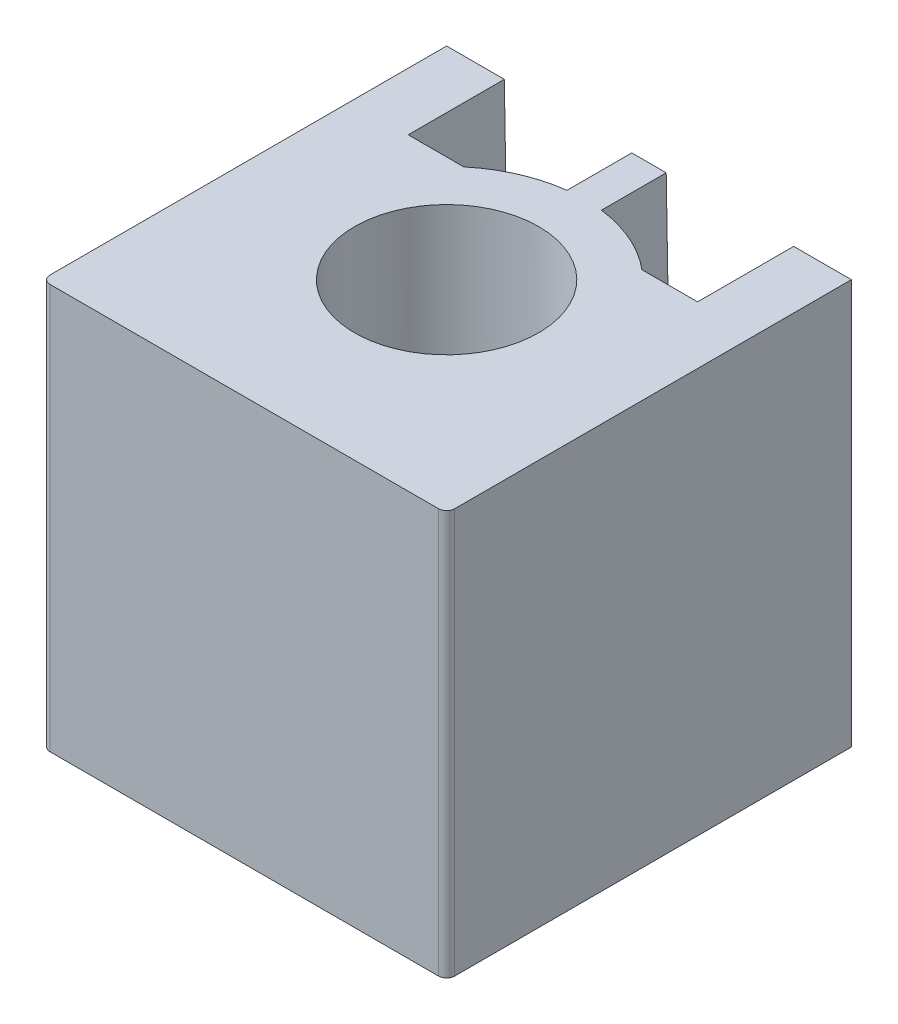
ISO-10303-21;
HEADER;
FILE_DESCRIPTION(('STEP AP214'),'2;1');
FILE_NAME('part.step','',(''),(''),'','','');
FILE_SCHEMA(('AUTOMOTIVE_DESIGN { 1 0 10303 214 1 1 1 1 }'));
ENDSEC;
DATA;
#1=APPLICATION_CONTEXT('core data for automotive mechanical design processes');
#2=APPLICATION_PROTOCOL_DEFINITION('international standard','automotive_design',2000,#1);
#3=PRODUCT_CONTEXT('',#1,'mechanical');
#4=PRODUCT('Part','Part','',(#3));
#5=PRODUCT_RELATED_PRODUCT_CATEGORY('part','',(#4));
#6=PRODUCT_DEFINITION_FORMATION('','',#4);
#7=PRODUCT_DEFINITION_CONTEXT('part definition',#1,'design');
#8=PRODUCT_DEFINITION('design','',#6,#7);
#9=PRODUCT_DEFINITION_SHAPE('','',#8);
#10=(LENGTH_UNIT() NAMED_UNIT(*) SI_UNIT(.MILLI.,.METRE.));
#11=(NAMED_UNIT(*) PLANE_ANGLE_UNIT() SI_UNIT($,.RADIAN.));
#12=(NAMED_UNIT(*) SI_UNIT($,.STERADIAN.) SOLID_ANGLE_UNIT());
#13=UNCERTAINTY_MEASURE_WITH_UNIT(LENGTH_MEASURE(1.E-05),#10,'distance_accuracy_value','');
#14=(GEOMETRIC_REPRESENTATION_CONTEXT(3) GLOBAL_UNCERTAINTY_ASSIGNED_CONTEXT((#13)) GLOBAL_UNIT_ASSIGNED_CONTEXT((#10,
#11,#12)) REPRESENTATION_CONTEXT('',''));
#15=CARTESIAN_POINT('',(0.,0.,0.));
#16=DIRECTION('',(0.,0.,1.));
#17=DIRECTION('',(1.,0.,0.));
#18=AXIS2_PLACEMENT_3D('',#15,#16,#17);
#19=CARTESIAN_POINT('',(0.,25.,-25.));
#20=DIRECTION('',(0.,0.,1.));
#21=DIRECTION('',(1.,0.,0.));
#22=AXIS2_PLACEMENT_3D('',#19,#20,#21);
#23=PLANE('',#22);
#24=DIRECTION('',(-1.,0.,0.));
#25=VECTOR('',#24,1.);
#26=CARTESIAN_POINT('',(0.,0.,-25.));
#27=LINE('',#26,#25);
#28=CARTESIAN_POINT('',(25.,0.,-25.));
#29=VERTEX_POINT('',#28);
#30=CARTESIAN_POINT('',(21.,0.,-25.));
#31=VERTEX_POINT('',#30);
#32=EDGE_CURVE('E333',#29,#31,#27,.T.);
#33=ORIENTED_EDGE('',*,*,#32,.T.);
#34=DIRECTION('',(0.0174524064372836,0.999847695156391,0.));
#35=VECTOR('',#34,1.);
#36=CARTESIAN_POINT('',(21.4298473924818,24.6259406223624,-25.));
#37=LINE('',#36,#35);
#38=CARTESIAN_POINT('',(21.4363766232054,25.,-25.));
#39=VERTEX_POINT('',#38);
#40=EDGE_CURVE('E351',#31,#39,#37,.T.);
#41=ORIENTED_EDGE('',*,*,#40,.T.);
#42=DIRECTION('',(-1.,0.,0.));
#43=VECTOR('',#42,1.);
#44=CARTESIAN_POINT('',(0.,25.,-25.));
#45=LINE('',#44,#43);
#46=CARTESIAN_POINT('',(25.,25.,-25.));
#47=VERTEX_POINT('',#46);
#48=EDGE_CURVE('E276',#47,#39,#45,.T.);
#49=ORIENTED_EDGE('',*,*,#48,.F.);
#50=DIRECTION('',(0.,-1.,0.));
#51=VECTOR('',#50,1.);
#52=CARTESIAN_POINT('',(25.,25.,-25.));
#53=LINE('',#52,#51);
#54=EDGE_CURVE('E305',#47,#29,#53,.T.);
#55=ORIENTED_EDGE('',*,*,#54,.T.);
#56=EDGE_LOOP('',(#33,#41,#49,#55));
#57=FACE_BOUND('',#56,.T.);
#58=ADVANCED_FACE('F26',(#57),#23,.F.);
#59=CARTESIAN_POINT('',(3.56362337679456,25.,-25.));
#60=VERTEX_POINT('',#59);
#61=CARTESIAN_POINT('',(0.,25.,-25.));
#62=VERTEX_POINT('',#61);
#63=EDGE_CURVE('E265',#60,#62,#45,.T.);
#64=ORIENTED_EDGE('',*,*,#63,.F.);
#65=DIRECTION('',(0.0174524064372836,-0.999847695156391,0.));
#66=VECTOR('',#65,1.);
#67=CARTESIAN_POINT('',(3.56253794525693,25.0621843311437,-25.));
#68=LINE('',#67,#66);
#69=CARTESIAN_POINT('',(4.,0.,-25.));
#70=VERTEX_POINT('',#69);
#71=EDGE_CURVE('E266',#60,#70,#68,.T.);
#72=ORIENTED_EDGE('',*,*,#71,.T.);
#73=CARTESIAN_POINT('',(0.,0.,-25.));
#74=VERTEX_POINT('',#73);
#75=EDGE_CURVE('E332',#70,#74,#27,.T.);
#76=ORIENTED_EDGE('',*,*,#75,.T.);
#77=DIRECTION('',(0.,-1.,0.));
#78=VECTOR('',#77,1.);
#79=CARTESIAN_POINT('',(0.,25.,-25.));
#80=LINE('',#79,#78);
#81=EDGE_CURVE('E269',#62,#74,#80,.T.);
#82=ORIENTED_EDGE('',*,*,#81,.F.);
#83=EDGE_LOOP('',(#64,#72,#76,#82));
#84=FACE_BOUND('',#83,.T.);
#85=ADVANCED_FACE('F250',(#84),#23,.F.);
#86=CARTESIAN_POINT('',(25.,25.,-25.));
#87=DIRECTION('',(-1.,0.,0.));
#88=DIRECTION('',(0.,0.,1.));
#89=AXIS2_PLACEMENT_3D('',#86,#87,#88);
#90=PLANE('',#89);
#91=DIRECTION('',(0.,0.,-1.));
#92=VECTOR('',#91,1.);
#93=CARTESIAN_POINT('',(25.,0.,-25.));
#94=LINE('',#93,#92);
#95=CARTESIAN_POINT('',(25.,0.,-0.500000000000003));
#96=VERTEX_POINT('',#95);
#97=EDGE_CURVE('E329',#96,#29,#94,.T.);
#98=ORIENTED_EDGE('',*,*,#97,.T.);
#99=ORIENTED_EDGE('',*,*,#54,.F.);
#100=DIRECTION('',(0.,0.,-1.));
#101=VECTOR('',#100,1.);
#102=CARTESIAN_POINT('',(25.,25.,-25.));
#103=LINE('',#102,#101);
#104=CARTESIAN_POINT('',(25.,25.,-0.500000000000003));
#105=VERTEX_POINT('',#104);
#106=EDGE_CURVE('E274',#105,#47,#103,.T.);
#107=ORIENTED_EDGE('',*,*,#106,.F.);
#108=DIRECTION('',(0.,-1.,0.));
#109=VECTOR('',#108,1.);
#110=CARTESIAN_POINT('',(25.,25.,-0.500000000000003));
#111=LINE('',#110,#109);
#112=EDGE_CURVE('E292',#105,#96,#111,.T.);
#113=ORIENTED_EDGE('',*,*,#112,.T.);
#114=EDGE_LOOP('',(#98,#99,#107,#113));
#115=FACE_BOUND('',#114,.T.);
#116=ADVANCED_FACE('F28',(#115),#90,.F.);
#117=CARTESIAN_POINT('',(13.5636233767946,25.,-25.));
#118=VERTEX_POINT('',#117);
#119=CARTESIAN_POINT('',(11.4363766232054,25.,-25.));
#120=VERTEX_POINT('',#119);
#121=EDGE_CURVE('E273',#118,#120,#45,.T.);
#122=ORIENTED_EDGE('',*,*,#121,.F.);
#123=DIRECTION('',(0.0174524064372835,-0.999847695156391,0.));
#124=VECTOR('',#123,1.);
#125=CARTESIAN_POINT('',(13.5594920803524,25.2366818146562,-25.));
#126=LINE('',#125,#124);
#127=CARTESIAN_POINT('',(14.,0.,-25.));
#128=VERTEX_POINT('',#127);
#129=EDGE_CURVE('E362',#118,#128,#126,.T.);
#130=ORIENTED_EDGE('',*,*,#129,.T.);
#131=CARTESIAN_POINT('',(11.,0.,-25.));
#132=VERTEX_POINT('',#131);
#133=EDGE_CURVE('E49',#128,#132,#27,.T.);
#134=ORIENTED_EDGE('',*,*,#133,.T.);
#135=DIRECTION('',(0.0174524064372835,0.999847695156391,0.));
#136=VECTOR('',#135,1.);
#137=CARTESIAN_POINT('',(11.4328932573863,24.8004381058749,-25.));
#138=LINE('',#137,#136);
#139=EDGE_CURVE('E314',#132,#120,#138,.T.);
#140=ORIENTED_EDGE('',*,*,#139,.T.);
#141=EDGE_LOOP('',(#122,#130,#134,#140));
#142=FACE_BOUND('',#141,.T.);
#143=ADVANCED_FACE('F247',(#142),#23,.F.);
#144=CARTESIAN_POINT('',(0.,25.,-25.));
#145=DIRECTION('',(1.,0.,0.));
#146=DIRECTION('',(0.,0.,-1.));
#147=AXIS2_PLACEMENT_3D('',#144,#145,#146);
#148=PLANE('',#147);
#149=DIRECTION('',(0.,0.,1.));
#150=VECTOR('',#149,1.);
#151=CARTESIAN_POINT('',(0.,0.,-25.));
#152=LINE('',#151,#150);
#153=CARTESIAN_POINT('',(0.,0.,-0.500000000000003));
#154=VERTEX_POINT('',#153);
#155=EDGE_CURVE('E336',#74,#154,#152,.T.);
#156=ORIENTED_EDGE('',*,*,#155,.T.);
#157=DIRECTION('',(0.,-1.,0.));
#158=VECTOR('',#157,1.);
#159=CARTESIAN_POINT('',(0.,25.,-0.500000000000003));
#160=LINE('',#159,#158);
#161=CARTESIAN_POINT('',(0.,25.,-0.500000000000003));
#162=VERTEX_POINT('',#161);
#163=EDGE_CURVE('E301',#162,#154,#160,.T.);
#164=ORIENTED_EDGE('',*,*,#163,.F.);
#165=DIRECTION('',(0.,0.,1.));
#166=VECTOR('',#165,1.);
#167=CARTESIAN_POINT('',(0.,25.,-25.));
#168=LINE('',#167,#166);
#169=EDGE_CURVE('E282',#62,#162,#168,.T.);
#170=ORIENTED_EDGE('',*,*,#169,.F.);
#171=ORIENTED_EDGE('',*,*,#81,.T.);
#172=EDGE_LOOP('',(#156,#164,#170,#171));
#173=FACE_BOUND('',#172,.T.);
#174=ADVANCED_FACE('F244',(#173),#148,.F.);
#175=CARTESIAN_POINT('',(0.5,25.,-0.5));
#176=DIRECTION('',(0.,-1.,0.));
#177=DIRECTION('',(0.,0.,-1.));
#178=AXIS2_PLACEMENT_3D('',#175,#176,#177);
#179=CYLINDRICAL_SURFACE('',#178,0.5);
#180=CARTESIAN_POINT('',(0.5,0.,-0.5));
#181=DIRECTION('',(0.,1.,0.));
#182=DIRECTION('',(0.,0.,1.));
#183=AXIS2_PLACEMENT_3D('',#180,#181,#182);
#184=CIRCLE('',#183,0.5);
#185=CARTESIAN_POINT('',(0.500000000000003,0.,0.));
#186=VERTEX_POINT('',#185);
#187=EDGE_CURVE('E338',#154,#186,#184,.T.);
#188=ORIENTED_EDGE('',*,*,#187,.T.);
#189=DIRECTION('',(0.,-1.,0.));
#190=VECTOR('',#189,1.);
#191=CARTESIAN_POINT('',(0.500000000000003,25.,0.));
#192=LINE('',#191,#190);
#193=CARTESIAN_POINT('',(0.500000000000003,25.,0.));
#194=VERTEX_POINT('',#193);
#195=EDGE_CURVE('E298',#194,#186,#192,.T.);
#196=ORIENTED_EDGE('',*,*,#195,.F.);
#197=CARTESIAN_POINT('',(0.5,25.,-0.5));
#198=DIRECTION('',(0.,1.,0.));
#199=DIRECTION('',(0.,0.,1.));
#200=AXIS2_PLACEMENT_3D('',#197,#198,#199);
#201=CIRCLE('',#200,0.5);
#202=EDGE_CURVE('E284',#162,#194,#201,.T.);
#203=ORIENTED_EDGE('',*,*,#202,.F.);
#204=ORIENTED_EDGE('',*,*,#163,.T.);
#205=EDGE_LOOP('',(#188,#196,#203,#204));
#206=FACE_BOUND('',#205,.T.);
#207=ADVANCED_FACE('F240',(#206),#179,.T.);
#208=CARTESIAN_POINT('',(0.500000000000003,25.,0.));
#209=DIRECTION('',(0.,0.,-1.));
#210=DIRECTION('',(-1.,0.,0.));
#211=AXIS2_PLACEMENT_3D('',#208,#209,#210);
#212=PLANE('',#211);
#213=DIRECTION('',(1.,0.,0.));
#214=VECTOR('',#213,1.);
#215=CARTESIAN_POINT('',(0.500000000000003,0.,0.));
#216=LINE('',#215,#214);
#217=CARTESIAN_POINT('',(24.5,0.,0.));
#218=VERTEX_POINT('',#217);
#219=EDGE_CURVE('E340',#186,#218,#216,.T.);
#220=ORIENTED_EDGE('',*,*,#219,.T.);
#221=DIRECTION('',(0.,-1.,0.));
#222=VECTOR('',#221,1.);
#223=CARTESIAN_POINT('',(24.5,25.,0.));
#224=LINE('',#223,#222);
#225=CARTESIAN_POINT('',(24.5,25.,0.));
#226=VERTEX_POINT('',#225);
#227=EDGE_CURVE('E295',#226,#218,#224,.T.);
#228=ORIENTED_EDGE('',*,*,#227,.F.);
#229=DIRECTION('',(1.,0.,0.));
#230=VECTOR('',#229,1.);
#231=CARTESIAN_POINT('',(0.500000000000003,25.,0.));
#232=LINE('',#231,#230);
#233=EDGE_CURVE('E286',#194,#226,#232,.T.);
#234=ORIENTED_EDGE('',*,*,#233,.F.);
#235=ORIENTED_EDGE('',*,*,#195,.T.);
#236=EDGE_LOOP('',(#220,#228,#234,#235));
#237=FACE_BOUND('',#236,.T.);
#238=ADVANCED_FACE('F236',(#237),#212,.F.);
#239=CARTESIAN_POINT('',(24.5,25.,-0.5));
#240=DIRECTION('',(0.,-1.,0.));
#241=DIRECTION('',(0.,0.,-1.));
#242=AXIS2_PLACEMENT_3D('',#239,#240,#241);
#243=CYLINDRICAL_SURFACE('',#242,0.5);
#244=CARTESIAN_POINT('',(24.5,0.,-0.5));
#245=DIRECTION('',(0.,1.,0.));
#246=DIRECTION('',(0.,0.,1.));
#247=AXIS2_PLACEMENT_3D('',#244,#245,#246);
#248=CIRCLE('',#247,0.5);
#249=EDGE_CURVE('E278',#218,#96,#248,.T.);
#250=ORIENTED_EDGE('',*,*,#249,.T.);
#251=ORIENTED_EDGE('',*,*,#112,.F.);
#252=CARTESIAN_POINT('',(24.5,25.,-0.5));
#253=DIRECTION('',(0.,1.,0.));
#254=DIRECTION('',(0.,0.,1.));
#255=AXIS2_PLACEMENT_3D('',#252,#253,#254);
#256=CIRCLE('',#255,0.5);
#257=EDGE_CURVE('E290',#226,#105,#256,.T.);
#258=ORIENTED_EDGE('',*,*,#257,.F.);
#259=ORIENTED_EDGE('',*,*,#227,.T.);
#260=EDGE_LOOP('',(#250,#251,#258,#259));
#261=FACE_BOUND('',#260,.T.);
#262=ADVANCED_FACE('F232',(#261),#243,.T.);
#263=CARTESIAN_POINT('',(24.5,25.,-0.5));
#264=DIRECTION('',(0.,1.,0.));
#265=DIRECTION('',(0.,0.,1.));
#266=AXIS2_PLACEMENT_3D('',#263,#264,#265);
#267=PLANE('',#266);
#268=CARTESIAN_POINT('',(12.5,25.,-12.5));
#269=DIRECTION('',(0.,-1.,0.));
#270=DIRECTION('',(0.,0.,-1.));
#271=AXIS2_PLACEMENT_3D('',#268,#269,#270);
#272=CIRCLE('',#271,5.68637662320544);
#273=CARTESIAN_POINT('',(12.5,25.,-18.1863766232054));
#274=VERTEX_POINT('',#273);
#275=EDGE_CURVE('E156',#274,#274,#272,.T.);
#276=ORIENTED_EDGE('',*,*,#275,.T.);
#277=EDGE_LOOP('',(#276));
#278=FACE_BOUND('',#277,.T.);
#279=DIRECTION('',(0.,0.,1.));
#280=VECTOR('',#279,1.);
#281=CARTESIAN_POINT('',(21.4363766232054,25.,-12.5));
#282=LINE('',#281,#280);
#283=CARTESIAN_POINT('',(21.4363766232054,25.,-19.0636233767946));
#284=VERTEX_POINT('',#283);
#285=EDGE_CURVE('E161',#39,#284,#282,.T.);
#286=ORIENTED_EDGE('',*,*,#285,.T.);
#287=DIRECTION('',(-1.,0.,0.));
#288=VECTOR('',#287,1.);
#289=CARTESIAN_POINT('',(12.5,25.,-19.0636233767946));
#290=LINE('',#289,#288);
#291=CARTESIAN_POINT('',(18.0004084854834,25.,-19.0636233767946));
#292=VERTEX_POINT('',#291);
#293=EDGE_CURVE('E367',#284,#292,#290,.T.);
#294=ORIENTED_EDGE('',*,*,#293,.T.);
#295=CARTESIAN_POINT('',(12.5,25.,-12.5));
#296=DIRECTION('',(0.,-1.,0.));
#297=DIRECTION('',(0.,0.,-1.));
#298=AXIS2_PLACEMENT_3D('',#295,#296,#297);
#299=CIRCLE('',#298,8.56362337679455);
#300=CARTESIAN_POINT('',(13.5636233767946,25.,-20.9973143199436));
#301=VERTEX_POINT('',#300);
#302=EDGE_CURVE('E148',#292,#301,#299,.F.);
#303=ORIENTED_EDGE('',*,*,#302,.T.);
#304=DIRECTION('',(0.,0.,-1.));
#305=VECTOR('',#304,1.);
#306=CARTESIAN_POINT('',(13.5636233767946,25.,-12.5));
#307=LINE('',#306,#305);
#308=EDGE_CURVE('E165',#301,#118,#307,.T.);
#309=ORIENTED_EDGE('',*,*,#308,.T.);
#310=ORIENTED_EDGE('',*,*,#121,.T.);
#311=DIRECTION('',(0.,0.,1.));
#312=VECTOR('',#311,1.);
#313=CARTESIAN_POINT('',(11.4363766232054,25.,-12.5));
#314=LINE('',#313,#312);
#315=CARTESIAN_POINT('',(11.4363766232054,25.,-20.9973143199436));
#316=VERTEX_POINT('',#315);
#317=EDGE_CURVE('E321',#120,#316,#314,.T.);
#318=ORIENTED_EDGE('',*,*,#317,.T.);
#319=CARTESIAN_POINT('',(12.5,25.,-12.5));
#320=DIRECTION('',(0.,-1.,0.));
#321=DIRECTION('',(0.,0.,-1.));
#322=AXIS2_PLACEMENT_3D('',#319,#320,#321);
#323=CIRCLE('',#322,8.56362337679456);
#324=CARTESIAN_POINT('',(6.99959151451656,25.,-19.0636233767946));
#325=VERTEX_POINT('',#324);
#326=EDGE_CURVE('E317',#316,#325,#323,.F.);
#327=ORIENTED_EDGE('',*,*,#326,.T.);
#328=DIRECTION('',(-1.,0.,0.));
#329=VECTOR('',#328,1.);
#330=CARTESIAN_POINT('',(12.5,25.,-19.0636233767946));
#331=LINE('',#330,#329);
#332=CARTESIAN_POINT('',(3.56362337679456,25.,-19.0636233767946));
#333=VERTEX_POINT('',#332);
#334=EDGE_CURVE('E210',#325,#333,#331,.T.);
#335=ORIENTED_EDGE('',*,*,#334,.T.);
#336=DIRECTION('',(0.,0.,-1.));
#337=VECTOR('',#336,1.);
#338=CARTESIAN_POINT('',(3.56362337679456,25.,-12.5));
#339=LINE('',#338,#337);
#340=EDGE_CURVE('E217',#333,#60,#339,.T.);
#341=ORIENTED_EDGE('',*,*,#340,.T.);
#342=ORIENTED_EDGE('',*,*,#63,.T.);
#343=ORIENTED_EDGE('',*,*,#169,.T.);
#344=ORIENTED_EDGE('',*,*,#202,.T.);
#345=ORIENTED_EDGE('',*,*,#233,.T.);
#346=ORIENTED_EDGE('',*,*,#257,.T.);
#347=ORIENTED_EDGE('',*,*,#106,.T.);
#348=ORIENTED_EDGE('',*,*,#48,.T.);
#349=EDGE_LOOP('',(#286,#294,#303,#309,#310,#318,#327,#335,#341,#342,#343,#344,#345,#346,#347,#348));
#350=FACE_BOUND('',#349,.T.);
#351=ADVANCED_FACE('F228',(#278,#350),#267,.T.);
#352=CARTESIAN_POINT('',(24.5,0.,-0.5));
#353=DIRECTION('',(0.,1.,0.));
#354=DIRECTION('',(0.,0.,1.));
#355=AXIS2_PLACEMENT_3D('',#352,#353,#354);
#356=PLANE('',#355);
#357=CARTESIAN_POINT('',(12.5,0.,-12.5));
#358=DIRECTION('',(0.,-1.,0.));
#359=DIRECTION('',(0.,0.,-1.));
#360=AXIS2_PLACEMENT_3D('',#357,#358,#359);
#361=CIRCLE('',#360,5.25);
#362=CARTESIAN_POINT('',(12.5,0.,-17.75));
#363=VERTEX_POINT('',#362);
#364=EDGE_CURVE('E407',#363,#363,#361,.T.);
#365=ORIENTED_EDGE('',*,*,#364,.F.);
#366=EDGE_LOOP('',(#365));
#367=FACE_BOUND('',#366,.T.);
#368=DIRECTION('',(-1.,0.,0.));
#369=VECTOR('',#368,1.);
#370=CARTESIAN_POINT('',(21.,0.,-19.5));
#371=LINE('',#370,#369);
#372=CARTESIAN_POINT('',(21.,0.,-19.5));
#373=VERTEX_POINT('',#372);
#374=CARTESIAN_POINT('',(18.1568542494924,0.,-19.5));
#375=VERTEX_POINT('',#374);
#376=EDGE_CURVE('E153',#373,#375,#371,.T.);
#377=ORIENTED_EDGE('',*,*,#376,.F.);
#378=DIRECTION('',(0.,0.,-1.));
#379=VECTOR('',#378,1.);
#380=CARTESIAN_POINT('',(21.,0.,-0.5));
#381=LINE('',#380,#379);
#382=EDGE_CURVE('E11',#373,#31,#381,.T.);
#383=ORIENTED_EDGE('',*,*,#382,.T.);
#384=ORIENTED_EDGE('',*,*,#32,.F.);
#385=ORIENTED_EDGE('',*,*,#97,.F.);
#386=ORIENTED_EDGE('',*,*,#249,.F.);
#387=ORIENTED_EDGE('',*,*,#219,.F.);
#388=ORIENTED_EDGE('',*,*,#187,.F.);
#389=ORIENTED_EDGE('',*,*,#155,.F.);
#390=ORIENTED_EDGE('',*,*,#75,.F.);
#391=DIRECTION('',(0.,0.,-1.));
#392=VECTOR('',#391,1.);
#393=CARTESIAN_POINT('',(4.,0.,-30.5));
#394=LINE('',#393,#392);
#395=CARTESIAN_POINT('',(4.,0.,-19.5));
#396=VERTEX_POINT('',#395);
#397=EDGE_CURVE('E358',#396,#70,#394,.T.);
#398=ORIENTED_EDGE('',*,*,#397,.F.);
#399=DIRECTION('',(-1.,0.,0.));
#400=VECTOR('',#399,1.);
#401=CARTESIAN_POINT('',(4.,0.,-19.5));
#402=LINE('',#401,#400);
#403=CARTESIAN_POINT('',(6.84314575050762,0.,-19.5));
#404=VERTEX_POINT('',#403);
#405=EDGE_CURVE('E325',#404,#396,#402,.T.);
#406=ORIENTED_EDGE('',*,*,#405,.F.);
#407=CARTESIAN_POINT('',(12.5,0.,-12.5));
#408=DIRECTION('',(0.,1.,0.));
#409=DIRECTION('',(0.,0.,-1.));
#410=AXIS2_PLACEMENT_3D('',#407,#408,#409);
#411=CIRCLE('',#410,9.);
#412=CARTESIAN_POINT('',(11.,0.,-21.3741196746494));
#413=VERTEX_POINT('',#412);
#414=EDGE_CURVE('E311',#413,#404,#411,.T.);
#415=ORIENTED_EDGE('',*,*,#414,.F.);
#416=DIRECTION('',(0.,0.,-1.));
#417=VECTOR('',#416,1.);
#418=CARTESIAN_POINT('',(11.,0.,-0.499999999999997));
#419=LINE('',#418,#417);
#420=EDGE_CURVE('E34',#413,#132,#419,.T.);
#421=ORIENTED_EDGE('',*,*,#420,.T.);
#422=ORIENTED_EDGE('',*,*,#133,.F.);
#423=DIRECTION('',(0.,0.,-1.));
#424=VECTOR('',#423,1.);
#425=CARTESIAN_POINT('',(14.,0.,-21.3741196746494));
#426=LINE('',#425,#424);
#427=CARTESIAN_POINT('',(14.,0.,-21.3741196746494));
#428=VERTEX_POINT('',#427);
#429=EDGE_CURVE('E159',#428,#128,#426,.T.);
#430=ORIENTED_EDGE('',*,*,#429,.F.);
#431=CARTESIAN_POINT('',(12.5,0.,-12.5));
#432=DIRECTION('',(0.,1.,0.));
#433=DIRECTION('',(0.,0.,-1.));
#434=AXIS2_PLACEMENT_3D('',#431,#432,#433);
#435=CIRCLE('',#434,9.);
#436=EDGE_CURVE('E145',#375,#428,#435,.T.);
#437=ORIENTED_EDGE('',*,*,#436,.F.);
#438=EDGE_LOOP('',(#377,#383,#384,#385,#386,#387,#388,#389,#390,#398,#406,#415,#421,#422,#430,#437));
#439=FACE_BOUND('',#438,.T.);
#440=ADVANCED_FACE('F158',(#367,#439),#356,.F.);
#441=CARTESIAN_POINT('',(4.,0.,-30.5));
#442=DIRECTION('',(-0.999847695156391,-0.0174524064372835,0.));
#443=DIRECTION('',(0.0174524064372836,-0.999847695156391,0.));
#444=AXIS2_PLACEMENT_3D('',#441,#442,#443);
#445=PLANE('',#444);
#446=ORIENTED_EDGE('',*,*,#340,.F.);
#447=DIRECTION('',(0.0174497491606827,-0.999695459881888,-0.0174497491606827));
#448=VECTOR('',#447,1.);
#449=CARTESIAN_POINT('',(4.,0.,-19.5));
#450=LINE('',#449,#448);
#451=EDGE_CURVE('E211',#333,#396,#450,.T.);
#452=ORIENTED_EDGE('',*,*,#451,.T.);
#453=ORIENTED_EDGE('',*,*,#397,.T.);
#454=ORIENTED_EDGE('',*,*,#71,.F.);
#455=EDGE_LOOP('',(#446,#452,#453,#454));
#456=FACE_BOUND('',#455,.T.);
#457=ADVANCED_FACE('F197',(#456),#445,.F.);
#458=CARTESIAN_POINT('',(11.,0.,-21.3741196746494));
#459=DIRECTION('',(0.999847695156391,-0.0174524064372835,0.));
#460=DIRECTION('',(0.0174524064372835,0.999847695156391,0.));
#461=AXIS2_PLACEMENT_3D('',#458,#459,#460);
#462=PLANE('',#461);
#463=ORIENTED_EDGE('',*,*,#420,.F.);
#464=CARTESIAN_POINT('',(11.4363766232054,25.,-20.9973143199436));
#465=CARTESIAN_POINT('',(11.3874183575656,22.1951828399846,-21.0405259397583));
#466=CARTESIAN_POINT('',(11.3384600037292,19.3903606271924,-21.0834089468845));
#467=CARTESIAN_POINT('',(11.240543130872,13.7807067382,-21.1685447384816));
#468=CARTESIAN_POINT('',(11.1915846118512,10.975875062,-21.2107975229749));
#469=CARTESIAN_POINT('',(11.0950840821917,5.44736342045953,-21.2934859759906));
#470=CARTESIAN_POINT('',(11.0475420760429,2.72368371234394,-21.3339388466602));
#471=CARTESIAN_POINT('',(11.,0.,-21.3741196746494));
#472=B_SPLINE_CURVE_WITH_KNOTS('',3,(#464,#465,#466,#467,#468,#469,#470,#471),.UNSPECIFIED.,.F.,
.F.,(4,2,2,4),(0.,8.41673158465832,16.8334628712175,25.0066476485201),.UNSPECIFIED.);
#473=EDGE_CURVE('E202',#316,#413,#472,.T.);
#474=ORIENTED_EDGE('',*,*,#473,.F.);
#475=ORIENTED_EDGE('',*,*,#317,.F.);
#476=ORIENTED_EDGE('',*,*,#139,.F.);
#477=EDGE_LOOP('',(#463,#474,#475,#476));
#478=FACE_BOUND('',#477,.T.);
#479=ADVANCED_FACE('F192',(#478),#462,.F.);
#480=CARTESIAN_POINT('',(4.,0.,-19.5));
#481=DIRECTION('',(0.,-0.0174524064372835,0.999847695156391));
#482=DIRECTION('',(0.,-0.999847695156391,-0.0174524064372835));
#483=AXIS2_PLACEMENT_3D('',#480,#481,#482);
#484=PLANE('',#483);
#485=ORIENTED_EDGE('',*,*,#405,.T.);
#486=ORIENTED_EDGE('',*,*,#451,.F.);
#487=ORIENTED_EDGE('',*,*,#334,.F.);
#488=CARTESIAN_POINT('',(6.99959151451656,25.,-19.0636233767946));
#489=CARTESIAN_POINT('',(6.96399404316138,19.3898133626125,-19.1615495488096));
#490=CARTESIAN_POINT('',(6.92872635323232,13.7796246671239,-19.2594757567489));
#491=CARTESIAN_POINT('',(6.87682984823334,5.44628976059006,-19.404934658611));
#492=CARTESIAN_POINT('',(6.85994895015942,2.72314512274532,-19.4524673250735));
#493=CARTESIAN_POINT('',(6.84314575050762,0.,-19.5));
#494=B_SPLINE_CURVE_WITH_KNOTS('',3,(#488,#489,#490,#491,#492,#493),.UNSPECIFIED.,.F.,.F.,(4,2,
4),(0.,16.8334623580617,25.0042976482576),.UNSPECIFIED.);
#495=EDGE_CURVE('E209',#325,#404,#494,.T.);
#496=ORIENTED_EDGE('',*,*,#495,.T.);
#497=EDGE_LOOP('',(#485,#486,#487,#496));
#498=FACE_BOUND('',#497,.T.);
#499=ADVANCED_FACE('F196',(#498),#484,.F.);
#500=CARTESIAN_POINT('',(12.5,0.,-12.5));
#501=DIRECTION('',(0.,-1.,0.));
#502=DIRECTION('',(0.,0.,-1.));
#503=AXIS2_PLACEMENT_3D('',#500,#501,#502);
#504=CONICAL_SURFACE('',#503,9.,0.0174532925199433);
#505=ORIENTED_EDGE('',*,*,#414,.T.);
#506=ORIENTED_EDGE('',*,*,#495,.F.);
#507=ORIENTED_EDGE('',*,*,#326,.F.);
#508=ORIENTED_EDGE('',*,*,#473,.T.);
#509=EDGE_LOOP('',(#505,#506,#507,#508));
#510=FACE_BOUND('',#509,.T.);
#511=ADVANCED_FACE('F190',(#510),#504,.T.);
#512=CARTESIAN_POINT('',(21.,0.,-30.5));
#513=DIRECTION('',(0.999847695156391,-0.0174524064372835,0.));
#514=DIRECTION('',(0.0174524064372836,0.999847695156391,0.));
#515=AXIS2_PLACEMENT_3D('',#512,#513,#514);
#516=PLANE('',#515);
#517=ORIENTED_EDGE('',*,*,#382,.F.);
#518=DIRECTION('',(-0.0174497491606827,-0.999695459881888,-0.0174497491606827));
#519=VECTOR('',#518,1.);
#520=CARTESIAN_POINT('',(20.9966505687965,-0.191888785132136,-19.5033494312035));
#521=LINE('',#520,#519);
#522=EDGE_CURVE('E41',#284,#373,#521,.T.);
#523=ORIENTED_EDGE('',*,*,#522,.F.);
#524=ORIENTED_EDGE('',*,*,#285,.F.);
#525=ORIENTED_EDGE('',*,*,#40,.F.);
#526=EDGE_LOOP('',(#517,#523,#524,#525));
#527=FACE_BOUND('',#526,.T.);
#528=ADVANCED_FACE('F186',(#527),#516,.F.);
#529=CARTESIAN_POINT('',(14.,0.,-21.3741196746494));
#530=DIRECTION('',(-0.999847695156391,-0.0174524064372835,0.));
#531=DIRECTION('',(0.0174524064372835,-0.999847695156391,0.));
#532=AXIS2_PLACEMENT_3D('',#529,#530,#531);
#533=PLANE('',#532);
#534=ORIENTED_EDGE('',*,*,#308,.F.);
#535=CARTESIAN_POINT('',(13.5636233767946,25.,-20.9973143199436));
#536=CARTESIAN_POINT('',(13.6125816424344,22.1951828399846,-21.0405259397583));
#537=CARTESIAN_POINT('',(13.6615399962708,19.3903606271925,-21.0834089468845));
#538=CARTESIAN_POINT('',(13.759456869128,13.7807067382,-21.1685447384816));
#539=CARTESIAN_POINT('',(13.8084153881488,10.975875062,-21.2107975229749));
#540=CARTESIAN_POINT('',(13.9049159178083,5.44736342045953,-21.2934859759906));
#541=CARTESIAN_POINT('',(13.9524579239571,2.72368371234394,-21.3339388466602));
#542=CARTESIAN_POINT('',(14.,0.,-21.3741196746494));
#543=B_SPLINE_CURVE_WITH_KNOTS('',3,(#535,#536,#537,#538,#539,#540,#541,#542),.UNSPECIFIED.,.F.,
.F.,(4,2,2,4),(0.,8.41673158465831,16.8334628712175,25.0066476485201),.UNSPECIFIED.);
#544=EDGE_CURVE('E150',#301,#428,#543,.T.);
#545=ORIENTED_EDGE('',*,*,#544,.T.);
#546=ORIENTED_EDGE('',*,*,#429,.T.);
#547=ORIENTED_EDGE('',*,*,#129,.F.);
#548=EDGE_LOOP('',(#534,#545,#546,#547));
#549=FACE_BOUND('',#548,.T.);
#550=ADVANCED_FACE('F181',(#549),#533,.F.);
#551=CARTESIAN_POINT('',(12.5,0.,-12.5));
#552=DIRECTION('',(0.,-1.,0.));
#553=DIRECTION('',(0.,0.,-1.));
#554=AXIS2_PLACEMENT_3D('',#551,#552,#553);
#555=CONICAL_SURFACE('',#554,9.,0.0174532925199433);
#556=ORIENTED_EDGE('',*,*,#436,.T.);
#557=ORIENTED_EDGE('',*,*,#544,.F.);
#558=ORIENTED_EDGE('',*,*,#302,.F.);
#559=CARTESIAN_POINT('',(18.0004084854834,25.,-19.0636233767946));
#560=CARTESIAN_POINT('',(18.0360059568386,19.3898133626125,-19.1615495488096));
#561=CARTESIAN_POINT('',(18.0712736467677,13.7796246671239,-19.2594757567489));
#562=CARTESIAN_POINT('',(18.1231701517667,5.44628976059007,-19.404934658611));
#563=CARTESIAN_POINT('',(18.1400510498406,2.72314512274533,-19.4524673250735));
#564=CARTESIAN_POINT('',(18.1568542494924,0.,-19.5));
#565=B_SPLINE_CURVE_WITH_KNOTS('',3,(#559,#560,#561,#562,#563,#564),.UNSPECIFIED.,.F.,.F.,(4,2,
4),(0.,16.8334623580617,25.0042976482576),.UNSPECIFIED.);
#566=EDGE_CURVE('E142',#292,#375,#565,.T.);
#567=ORIENTED_EDGE('',*,*,#566,.T.);
#568=EDGE_LOOP('',(#556,#557,#558,#567));
#569=FACE_BOUND('',#568,.T.);
#570=ADVANCED_FACE('F143',(#569),#555,.T.);
#571=CARTESIAN_POINT('',(21.,0.,-19.5));
#572=DIRECTION('',(0.,-0.0174524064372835,0.999847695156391));
#573=DIRECTION('',(0.,-0.999847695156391,-0.0174524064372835));
#574=AXIS2_PLACEMENT_3D('',#571,#572,#573);
#575=PLANE('',#574);
#576=ORIENTED_EDGE('',*,*,#376,.T.);
#577=ORIENTED_EDGE('',*,*,#566,.F.);
#578=ORIENTED_EDGE('',*,*,#293,.F.);
#579=ORIENTED_EDGE('',*,*,#522,.T.);
#580=EDGE_LOOP('',(#576,#577,#578,#579));
#581=FACE_BOUND('',#580,.T.);
#582=ADVANCED_FACE('F154',(#581),#575,.F.);
#583=CARTESIAN_POINT('',(12.5,0.,-12.5));
#584=DIRECTION('',(0.,1.,0.));
#585=DIRECTION('',(0.,0.,-1.));
#586=AXIS2_PLACEMENT_3D('',#583,#584,#585);
#587=CONICAL_SURFACE('',#586,5.25,0.0174532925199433);
#588=ORIENTED_EDGE('',*,*,#275,.F.);
#589=EDGE_LOOP('',(#588));
#590=FACE_BOUND('',#589,.T.);
#591=ORIENTED_EDGE('',*,*,#364,.T.);
#592=EDGE_LOOP('',(#591));
#593=FACE_BOUND('',#592,.T.);
#594=ADVANCED_FACE('F394',(#590,#593),#587,.F.);
#595=CLOSED_SHELL('',(#58,#85,#116,#143,#174,#207,#238,#262,#351,#440,#457,#479,#499,#511,#528,
#550,#570,#582,#594));
#596=MANIFOLD_SOLID_BREP('B2',#595);
#597=ADVANCED_BREP_SHAPE_REPRESENTATION('',(#18,#596),#14);
#598=SHAPE_DEFINITION_REPRESENTATION(#9,#597);
ENDSEC;
END-ISO-10303-21;
